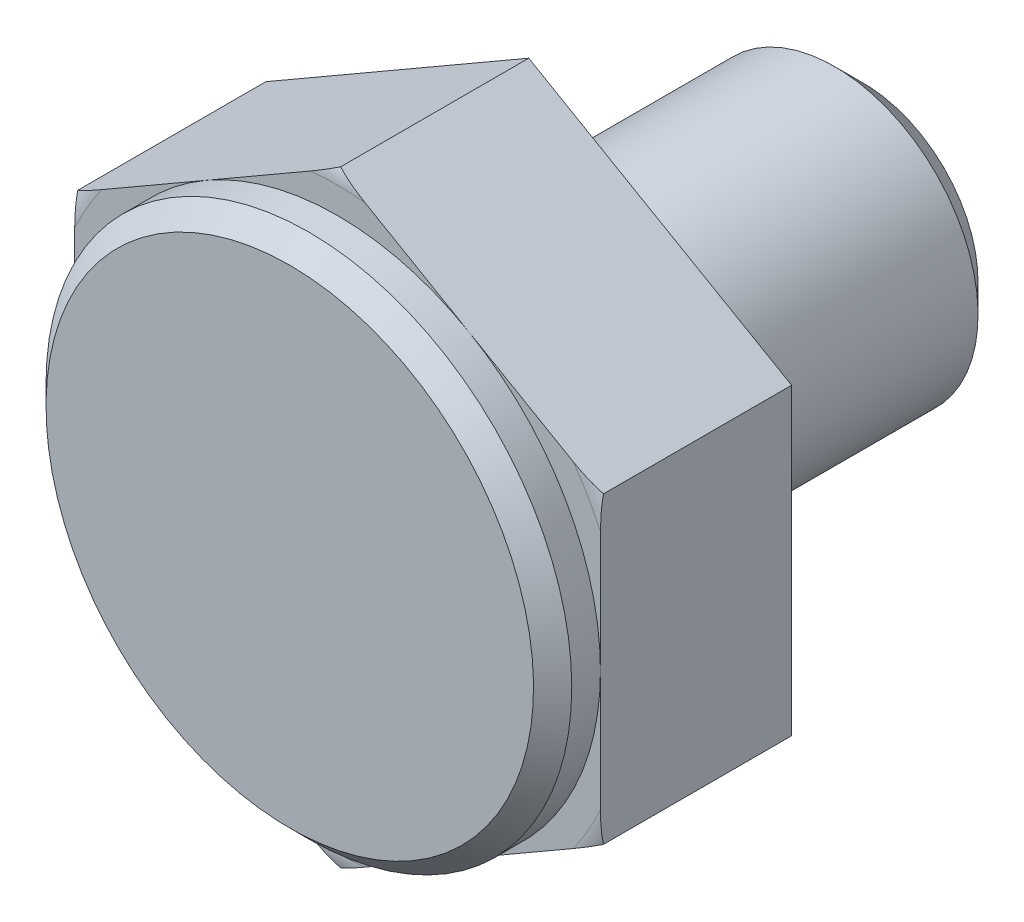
ISO-10303-21;
HEADER;
FILE_DESCRIPTION(('STEP AP214'),'2;1');
FILE_NAME('part.step','',(''),(''),'','','');
FILE_SCHEMA(('AUTOMOTIVE_DESIGN { 1 0 10303 214 1 1 1 1 }'));
ENDSEC;
DATA;
#1=APPLICATION_CONTEXT('core data for automotive mechanical design processes');
#2=APPLICATION_PROTOCOL_DEFINITION('international standard','automotive_design',2000,#1);
#3=PRODUCT_CONTEXT('',#1,'mechanical');
#4=PRODUCT('Part','Part','',(#3));
#5=PRODUCT_RELATED_PRODUCT_CATEGORY('part','',(#4));
#6=PRODUCT_DEFINITION_FORMATION('','',#4);
#7=PRODUCT_DEFINITION_CONTEXT('part definition',#1,'design');
#8=PRODUCT_DEFINITION('design','',#6,#7);
#9=PRODUCT_DEFINITION_SHAPE('','',#8);
#10=(LENGTH_UNIT() NAMED_UNIT(*) SI_UNIT(.MILLI.,.METRE.));
#11=(NAMED_UNIT(*) PLANE_ANGLE_UNIT() SI_UNIT($,.RADIAN.));
#12=(NAMED_UNIT(*) SI_UNIT($,.STERADIAN.) SOLID_ANGLE_UNIT());
#13=UNCERTAINTY_MEASURE_WITH_UNIT(LENGTH_MEASURE(1.E-05),#10,'distance_accuracy_value','');
#14=(GEOMETRIC_REPRESENTATION_CONTEXT(3) GLOBAL_UNCERTAINTY_ASSIGNED_CONTEXT((#13)) GLOBAL_UNIT_ASSIGNED_CONTEXT((#10,
#11,#12)) REPRESENTATION_CONTEXT('',''));
#15=CARTESIAN_POINT('',(0.,0.,0.));
#16=DIRECTION('',(0.,0.,1.));
#17=DIRECTION('',(1.,0.,0.));
#18=AXIS2_PLACEMENT_3D('',#15,#16,#17);
#19=CARTESIAN_POINT('',(5.1,0.,10.));
#20=DIRECTION('',(0.,0.,1.));
#21=DIRECTION('',(0.,-1.,0.));
#22=AXIS2_PLACEMENT_3D('',#19,#20,#21);
#23=PLANE('',#22);
#24=CARTESIAN_POINT('',(0.,0.,10.));
#25=DIRECTION('',(0.,0.,-1.));
#26=DIRECTION('',(0.,1.,0.));
#27=AXIS2_PLACEMENT_3D('',#24,#25,#26);
#28=CIRCLE('',#27,10.2);
#29=CARTESIAN_POINT('',(0.,10.2,10.));
#30=VERTEX_POINT('',#29);
#31=EDGE_CURVE('E18',#30,#30,#28,.T.);
#32=ORIENTED_EDGE('',*,*,#31,.F.);
#33=EDGE_LOOP('',(#32));
#34=FACE_BOUND('',#33,.T.);
#35=ADVANCED_FACE('F14',(#34),#23,.T.);
#36=CARTESIAN_POINT('',(2.4,0.,-14.));
#37=DIRECTION('',(0.,0.,-1.));
#38=DIRECTION('',(0.,1.,0.));
#39=AXIS2_PLACEMENT_3D('',#36,#37,#38);
#40=PLANE('',#39);
#41=CARTESIAN_POINT('',(0.,0.,-14.00000000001));
#42=DIRECTION('',(0.,0.,1.));
#43=DIRECTION('',(0.,-1.,0.));
#44=AXIS2_PLACEMENT_3D('',#41,#42,#43);
#45=CIRCLE('',#44,4.79999999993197);
#46=CARTESIAN_POINT('',(0.,-4.79999999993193,-14.00000000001));
#47=VERTEX_POINT('',#46);
#48=EDGE_CURVE('E150',#47,#47,#45,.T.);
#49=ORIENTED_EDGE('',*,*,#48,.F.);
#50=EDGE_LOOP('',(#49));
#51=FACE_BOUND('',#50,.T.);
#52=ADVANCED_FACE('F648',(#51),#40,.T.);
#53=CARTESIAN_POINT('',(0.,0.,9.2));
#54=DIRECTION('',(0.,0.,-1.));
#55=DIRECTION('',(0.,1.,0.));
#56=AXIS2_PLACEMENT_3D('',#53,#54,#55);
#57=CONICAL_SURFACE('',#56,11.,0.785398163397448);
#58=CARTESIAN_POINT('',(0.,0.,9.2));
#59=DIRECTION('',(0.,0.,1.));
#60=DIRECTION('',(0.,-1.,0.));
#61=AXIS2_PLACEMENT_3D('',#58,#59,#60);
#62=CIRCLE('',#61,11.);
#63=CARTESIAN_POINT('',(0.,-11.,9.19999999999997));
#64=VERTEX_POINT('',#63);
#65=EDGE_CURVE('E248',#64,#64,#62,.F.);
#66=ORIENTED_EDGE('',*,*,#65,.F.);
#67=EDGE_LOOP('',(#66));
#68=FACE_BOUND('',#67,.T.);
#69=ORIENTED_EDGE('',*,*,#31,.T.);
#70=EDGE_LOOP('',(#69));
#71=FACE_BOUND('',#70,.T.);
#72=ADVANCED_FACE('F645',(#68,#71),#57,.T.);
#73=CARTESIAN_POINT('',(0.,0.,-12.800000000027));
#74=DIRECTION('',(0.,0.,1.));
#75=DIRECTION('',(0.,-1.,0.));
#76=AXIS2_PLACEMENT_3D('',#73,#74,#75);
#77=CONICAL_SURFACE('',#76,5.99999999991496,0.785398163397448);
#78=CARTESIAN_POINT('',(0.,0.,-12.8));
#79=DIRECTION('',(0.,0.,1.));
#80=DIRECTION('',(0.,-1.,0.));
#81=AXIS2_PLACEMENT_3D('',#78,#79,#80);
#82=CIRCLE('',#81,6.);
#83=CARTESIAN_POINT('',(0.,-5.99999999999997,-12.8));
#84=VERTEX_POINT('',#83);
#85=EDGE_CURVE('E240',#84,#84,#82,.T.);
#86=ORIENTED_EDGE('',*,*,#85,.F.);
#87=EDGE_LOOP('',(#86));
#88=FACE_BOUND('',#87,.T.);
#89=ORIENTED_EDGE('',*,*,#48,.T.);
#90=EDGE_LOOP('',(#89));
#91=FACE_BOUND('',#90,.T.);
#92=ADVANCED_FACE('F176',(#88,#91),#77,.T.);
#93=CARTESIAN_POINT('',(0.,0.,6.50000000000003));
#94=DIRECTION('',(0.,0.,1.));
#95=DIRECTION('',(0.,-1.,0.));
#96=AXIS2_PLACEMENT_3D('',#93,#94,#95);
#97=TOROIDAL_SURFACE('',#96,12.1,1.5);
#98=CARTESIAN_POINT('',(11.,6.35085296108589,7.87402692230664));
#99=CARTESIAN_POINT('',(10.9533847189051,6.37776630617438,7.88580897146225));
#100=CARTESIAN_POINT('',(10.9065853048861,6.40478596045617,7.89659032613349));
#101=CARTESIAN_POINT('',(10.8128105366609,6.45892684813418,7.91627738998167));
#102=CARTESIAN_POINT('',(10.7658359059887,6.48604766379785,7.92518768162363));
#103=CARTESIAN_POINT('',(10.6717358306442,6.54037636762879,7.94130420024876));
#104=CARTESIAN_POINT('',(10.6246106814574,6.56758408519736,7.94851274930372));
#105=CARTESIAN_POINT('',(10.5302268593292,6.62207661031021,7.96136874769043));
#106=CARTESIAN_POINT('',(10.4829682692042,6.64936137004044,7.96701701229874));
#107=CARTESIAN_POINT('',(10.3883607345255,6.70398305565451,7.97687519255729));
#108=CARTESIAN_POINT('',(10.3410118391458,6.73131995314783,7.9810857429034));
#109=CARTESIAN_POINT('',(10.2461988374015,6.78606026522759,7.98818440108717));
#110=CARTESIAN_POINT('',(10.198734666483,6.81346371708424,7.99107134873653));
#111=CARTESIAN_POINT('',(10.1036948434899,6.86833498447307,7.99562221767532));
#112=CARTESIAN_POINT('',(10.0561191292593,6.89580283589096,7.99728437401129));
#113=CARTESIAN_POINT('',(9.9608582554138,6.95080172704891,7.99947376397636));
#114=CARTESIAN_POINT('',(9.9131730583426,6.97833278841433,7.9999988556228));
#115=CARTESIAN_POINT('',(9.86548966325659,7.00586280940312,8.));
#116=B_SPLINE_CURVE_WITH_KNOTS('',3,(#98,#99,#100,#101,#102,#103,#104,#105,#106,#107,#108,#109,
#110,#111,#112,#113,#114,#115),.UNSPECIFIED.,.F.,.F.,(4,2,2,2,2,2,2,2,4),(0.,0.165284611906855,
0.330159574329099,0.494808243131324,0.65937071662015,0.823860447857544,0.988494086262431,
1.1533645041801,1.31854523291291),.UNSPECIFIED.);
#117=CARTESIAN_POINT('',(11.,6.35085296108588,7.87402692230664));
#118=VERTEX_POINT('',#117);
#119=CARTESIAN_POINT('',(9.86548966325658,7.00586280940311,8.));
#120=VERTEX_POINT('',#119);
#121=EDGE_CURVE('E123',#118,#120,#116,.T.);
#122=ORIENTED_EDGE('',*,*,#121,.T.);
#123=CARTESIAN_POINT('',(0.,0.,8.00000000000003));
#124=DIRECTION('',(0.,0.,-1.));
#125=DIRECTION('',(0.81532972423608,0.578996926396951,0.));
#126=AXIS2_PLACEMENT_3D('',#123,#124,#125);
#127=CIRCLE('',#126,12.1);
#128=CARTESIAN_POINT('',(11.,5.0408332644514,8.));
#129=VERTEX_POINT('',#128);
#130=EDGE_CURVE('E147',#129,#120,#127,.F.);
#131=ORIENTED_EDGE('',*,*,#130,.F.);
#132=CARTESIAN_POINT('',(11.,5.0408332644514,8.));
#133=CARTESIAN_POINT('',(11.,5.09589330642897,7.9999988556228));
#134=CARTESIAN_POINT('',(11.,5.15095542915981,7.99947376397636));
#135=CARTESIAN_POINT('',(11.,5.26095321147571,7.99728437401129));
#136=CARTESIAN_POINT('',(11.,5.31588891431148,7.99562221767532));
#137=CARTESIAN_POINT('',(11.,5.42563144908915,7.99107134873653));
#138=CARTESIAN_POINT('',(11.,5.48043835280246,7.98818440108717));
#139=CARTESIAN_POINT('',(11.,5.58991897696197,7.9810857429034));
#140=CARTESIAN_POINT('',(11.,5.64459277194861,7.97687519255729));
#141=CARTESIAN_POINT('',(11.,5.75383614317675,7.96701701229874));
#142=CARTESIAN_POINT('',(11.,5.80840566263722,7.96136874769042));
#143=CARTESIAN_POINT('',(11.,5.91739071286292,7.94851274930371));
#144=CARTESIAN_POINT('',(11.,5.97180614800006,7.94130420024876));
#145=CARTESIAN_POINT('',(11.,6.08046355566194,7.92518768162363));
#146=CARTESIAN_POINT('',(11.,6.13470518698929,7.91627738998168));
#147=CARTESIAN_POINT('',(11.,6.24298696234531,7.89659032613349));
#148=CARTESIAN_POINT('',(11.,6.29702627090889,7.88580897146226));
#149=CARTESIAN_POINT('',(11.,6.35085296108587,7.87402692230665));
#150=B_SPLINE_CURVE_WITH_KNOTS('',3,(#132,#133,#134,#135,#136,#137,#138,#139,#140,#141,#142,
#143,#144,#145,#146,#147,#148,#149),.UNSPECIFIED.,.F.,.F.,(4,2,2,2,2,2,2,2,4),(0.,
0.16518072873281,0.330051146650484,0.494684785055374,0.659174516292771,0.8237369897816,
0.988385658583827,1.15326062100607,1.31854523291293),.UNSPECIFIED.);
#151=EDGE_CURVE('E136',#129,#118,#150,.T.);
#152=ORIENTED_EDGE('',*,*,#151,.T.);
#153=EDGE_LOOP('',(#122,#131,#152));
#154=FACE_BOUND('',#153,.T.);
#155=ADVANCED_FACE('F146',(#154),#97,.T.);
#156=CARTESIAN_POINT('',(0.,0.,6.50000000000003));
#157=DIRECTION('',(0.,0.,1.));
#158=DIRECTION('',(0.,-1.,0.));
#159=AXIS2_PLACEMENT_3D('',#156,#157,#158);
#160=TOROIDAL_SURFACE('',#159,12.1,1.5);
#161=CARTESIAN_POINT('',(0.,0.,8.00000000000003));
#162=DIRECTION('',(0.,0.,-1.));
#163=DIRECTION('',(0.909090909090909,-0.416597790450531,0.));
#164=AXIS2_PLACEMENT_3D('',#161,#162,#163);
#165=CIRCLE('',#164,12.1);
#166=CARTESIAN_POINT('',(9.86548966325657,-7.00586280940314,8.));
#167=VERTEX_POINT('',#166);
#168=CARTESIAN_POINT('',(11.,-5.04083326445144,8.));
#169=VERTEX_POINT('',#168);
#170=EDGE_CURVE('E227',#167,#169,#165,.F.);
#171=ORIENTED_EDGE('',*,*,#170,.F.);
#172=CARTESIAN_POINT('',(9.86548966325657,-7.00586280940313,8.));
#173=CARTESIAN_POINT('',(9.91317305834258,-6.97833278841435,7.99999885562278));
#174=CARTESIAN_POINT('',(9.96085825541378,-6.95080172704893,7.99947376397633));
#175=CARTESIAN_POINT('',(10.0561191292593,-6.89580283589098,7.99728437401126));
#176=CARTESIAN_POINT('',(10.1036948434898,-6.86833498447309,7.99562221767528));
#177=CARTESIAN_POINT('',(10.198734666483,-6.81346371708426,7.9910713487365));
#178=CARTESIAN_POINT('',(10.2461988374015,-6.78606026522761,7.98818440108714));
#179=CARTESIAN_POINT('',(10.3410118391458,-6.73131995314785,7.98108574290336));
#180=CARTESIAN_POINT('',(10.3883607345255,-6.70398305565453,7.97687519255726));
#181=CARTESIAN_POINT('',(10.4829682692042,-6.64936137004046,7.96701701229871));
#182=CARTESIAN_POINT('',(10.5302268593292,-6.62207661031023,7.96136874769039));
#183=CARTESIAN_POINT('',(10.6246106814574,-6.56758408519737,7.94851274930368));
#184=CARTESIAN_POINT('',(10.6717358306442,-6.54037636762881,7.94130420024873));
#185=CARTESIAN_POINT('',(10.7658359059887,-6.48604766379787,7.9251876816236));
#186=CARTESIAN_POINT('',(10.8128105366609,-6.45892684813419,7.91627738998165));
#187=CARTESIAN_POINT('',(10.9065853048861,-6.40478596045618,7.89659032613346));
#188=CARTESIAN_POINT('',(10.9533847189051,-6.37776630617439,7.88580897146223));
#189=CARTESIAN_POINT('',(11.,-6.3508529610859,7.87402692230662));
#190=B_SPLINE_CURVE_WITH_KNOTS('',3,(#172,#173,#174,#175,#176,#177,#178,#179,#180,#181,#182,
#183,#184,#185,#186,#187,#188,#189),.UNSPECIFIED.,.F.,.F.,(4,2,2,2,2,2,2,2,4),(0.,
0.165180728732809,0.330051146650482,0.494684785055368,0.659174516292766,0.823736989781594,
0.988385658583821,1.15326062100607,1.31854523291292),.UNSPECIFIED.);
#191=CARTESIAN_POINT('',(11.,-6.3508529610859,7.87402692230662));
#192=VERTEX_POINT('',#191);
#193=EDGE_CURVE('E585',#167,#192,#190,.T.);
#194=ORIENTED_EDGE('',*,*,#193,.T.);
#195=CARTESIAN_POINT('',(11.,-6.3508529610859,7.87402692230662));
#196=CARTESIAN_POINT('',(11.,-6.29702627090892,7.88580897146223));
#197=CARTESIAN_POINT('',(11.,-6.24298696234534,7.89659032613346));
#198=CARTESIAN_POINT('',(11.,-6.13470518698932,7.91627738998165));
#199=CARTESIAN_POINT('',(11.,-6.08046355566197,7.9251876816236));
#200=CARTESIAN_POINT('',(11.,-5.97180614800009,7.94130420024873));
#201=CARTESIAN_POINT('',(11.,-5.91739071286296,7.94851274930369));
#202=CARTESIAN_POINT('',(11.,-5.80840566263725,7.9613687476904));
#203=CARTESIAN_POINT('',(11.,-5.75383614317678,7.96701701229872));
#204=CARTESIAN_POINT('',(11.,-5.64459277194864,7.97687519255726));
#205=CARTESIAN_POINT('',(11.,-5.589918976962,7.98108574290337));
#206=CARTESIAN_POINT('',(11.,-5.48043835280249,7.98818440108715));
#207=CARTESIAN_POINT('',(11.,-5.42563144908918,7.9910713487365));
#208=CARTESIAN_POINT('',(11.,-5.31588891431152,7.99562221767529));
#209=CARTESIAN_POINT('',(11.,-5.26095321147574,7.99728437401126));
#210=CARTESIAN_POINT('',(11.,-5.15095542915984,7.99947376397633));
#211=CARTESIAN_POINT('',(11.,-5.095893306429,7.99999885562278));
#212=CARTESIAN_POINT('',(11.,-5.04083326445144,8.));
#213=B_SPLINE_CURVE_WITH_KNOTS('',3,(#195,#196,#197,#198,#199,#200,#201,#202,#203,#204,#205,
#206,#207,#208,#209,#210,#211,#212),.UNSPECIFIED.,.F.,.F.,(4,2,2,2,2,2,2,2,4),(0.,
0.165284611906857,0.330159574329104,0.49480824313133,0.659370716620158,0.823860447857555,
0.988494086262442,1.15336450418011,1.31854523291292),.UNSPECIFIED.);
#214=EDGE_CURVE('E118',#192,#169,#213,.T.);
#215=ORIENTED_EDGE('',*,*,#214,.T.);
#216=EDGE_LOOP('',(#171,#194,#215));
#217=FACE_BOUND('',#216,.T.);
#218=ADVANCED_FACE('F175',(#217),#160,.T.);
#219=CARTESIAN_POINT('',(0.,0.,6.50000000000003));
#220=DIRECTION('',(0.,0.,1.));
#221=DIRECTION('',(0.,-1.,0.));
#222=AXIS2_PLACEMENT_3D('',#219,#220,#221);
#223=TOROIDAL_SURFACE('',#222,12.1,1.5);
#224=CARTESIAN_POINT('',(0.,0.,8.00000000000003));
#225=DIRECTION('',(0.,0.,-1.));
#226=DIRECTION('',(0.0937611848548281,-0.995594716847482,0.));
#227=AXIS2_PLACEMENT_3D('',#224,#225,#226);
#228=CIRCLE('',#227,12.1);
#229=CARTESIAN_POINT('',(-1.13451033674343,-12.0466960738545,8.));
#230=VERTEX_POINT('',#229);
#231=CARTESIAN_POINT('',(1.13451033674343,-12.0466960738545,8.));
#232=VERTEX_POINT('',#231);
#233=EDGE_CURVE('E265',#230,#232,#228,.F.);
#234=ORIENTED_EDGE('',*,*,#233,.F.);
#235=CARTESIAN_POINT('',(-1.13451033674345,-12.0466960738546,8.));
#236=CARTESIAN_POINT('',(-1.08682694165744,-12.0742260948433,7.99999885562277));
#237=CARTESIAN_POINT('',(-1.03914174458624,-12.1017571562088,7.99947376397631));
#238=CARTESIAN_POINT('',(-0.943880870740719,-12.1567560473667,7.99728437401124));
#239=CARTESIAN_POINT('',(-0.896305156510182,-12.1842238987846,7.99562221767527));
#240=CARTESIAN_POINT('',(-0.801265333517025,-12.2390951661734,7.99107134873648));
#241=CARTESIAN_POINT('',(-0.753801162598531,-12.2664986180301,7.98818440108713));
#242=CARTESIAN_POINT('',(-0.658988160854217,-12.3212389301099,7.98108574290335));
#243=CARTESIAN_POINT('',(-0.611639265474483,-12.3485758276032,7.97687519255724));
#244=CARTESIAN_POINT('',(-0.51703173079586,-12.4031975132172,7.96701701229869));
#245=CARTESIAN_POINT('',(-0.469773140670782,-12.4304822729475,7.96136874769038));
#246=CARTESIAN_POINT('',(-0.375389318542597,-12.4849747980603,7.94851274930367));
#247=CARTESIAN_POINT('',(-0.328264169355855,-12.5121825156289,7.94130420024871));
#248=CARTESIAN_POINT('',(-0.234164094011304,-12.5665112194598,7.92518768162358));
#249=CARTESIAN_POINT('',(-0.187189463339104,-12.5936320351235,7.91627738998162));
#250=CARTESIAN_POINT('',(-0.0934146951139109,-12.6477729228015,7.89659032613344));
#251=CARTESIAN_POINT('',(-0.0466152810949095,-12.6747925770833,7.8858089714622));
#252=CARTESIAN_POINT('',(0.,-12.7017059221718,7.87402692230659));
#253=B_SPLINE_CURVE_WITH_KNOTS('',3,(#235,#236,#237,#238,#239,#240,#241,#242,#243,#244,#245,
#246,#247,#248,#249,#250,#251,#252),.UNSPECIFIED.,.F.,.F.,(4,2,2,2,2,2,2,2,4),(0.,
0.165180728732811,0.330051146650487,0.494684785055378,0.659174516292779,0.823736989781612,
0.98838565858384,1.15326062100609,1.31854523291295),.UNSPECIFIED.);
#254=CARTESIAN_POINT('',(0.,-12.7017059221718,7.8740269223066));
#255=VERTEX_POINT('',#254);
#256=EDGE_CURVE('E542',#230,#255,#253,.T.);
#257=ORIENTED_EDGE('',*,*,#256,.T.);
#258=CARTESIAN_POINT('',(0.,-12.7017059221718,7.8740269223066));
#259=CARTESIAN_POINT('',(0.0466152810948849,-12.6747925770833,7.88580897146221));
#260=CARTESIAN_POINT('',(0.09341469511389,-12.6477729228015,7.89659032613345));
#261=CARTESIAN_POINT('',(0.187189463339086,-12.5936320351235,7.91627738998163));
#262=CARTESIAN_POINT('',(0.234164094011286,-12.5665112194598,7.92518768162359));
#263=CARTESIAN_POINT('',(0.328264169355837,-12.5121825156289,7.94130420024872));
#264=CARTESIAN_POINT('',(0.375389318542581,-12.4849747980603,7.94851274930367));
#265=CARTESIAN_POINT('',(0.469773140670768,-12.4304822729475,7.96136874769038));
#266=CARTESIAN_POINT('',(0.517031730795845,-12.4031975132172,7.9670170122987));
#267=CARTESIAN_POINT('',(0.611639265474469,-12.3485758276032,7.97687519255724));
#268=CARTESIAN_POINT('',(0.658988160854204,-12.3212389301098,7.98108574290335));
#269=CARTESIAN_POINT('',(0.753801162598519,-12.2664986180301,7.98818440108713));
#270=CARTESIAN_POINT('',(0.801265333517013,-12.2390951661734,7.99107134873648));
#271=CARTESIAN_POINT('',(0.896305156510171,-12.1842238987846,7.99562221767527));
#272=CARTESIAN_POINT('',(0.943880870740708,-12.1567560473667,7.99728437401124));
#273=CARTESIAN_POINT('',(1.03914174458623,-12.1017571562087,7.99947376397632));
#274=CARTESIAN_POINT('',(1.08682694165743,-12.0742260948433,7.99999885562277));
#275=CARTESIAN_POINT('',(1.13451033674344,-12.0466960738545,8.));
#276=B_SPLINE_CURVE_WITH_KNOTS('',3,(#258,#259,#260,#261,#262,#263,#264,#265,#266,#267,#268,
#269,#270,#271,#272,#273,#274,#275),.UNSPECIFIED.,.F.,.F.,(4,2,2,2,2,2,2,2,4),(0.,
0.165284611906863,0.330159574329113,0.494808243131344,0.659370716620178,0.823860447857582,
0.988494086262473,1.15336450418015,1.31854523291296),.UNSPECIFIED.);
#277=EDGE_CURVE('E592',#255,#232,#276,.T.);
#278=ORIENTED_EDGE('',*,*,#277,.T.);
#279=EDGE_LOOP('',(#234,#257,#278));
#280=FACE_BOUND('',#279,.T.);
#281=ADVANCED_FACE('F190',(#280),#223,.T.);
#282=CARTESIAN_POINT('',(0.,0.,6.50000000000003));
#283=DIRECTION('',(0.,0.,1.));
#284=DIRECTION('',(0.,-1.,0.));
#285=AXIS2_PLACEMENT_3D('',#282,#283,#284);
#286=TOROIDAL_SURFACE('',#285,12.1,1.5);
#287=CARTESIAN_POINT('',(0.,0.,8.00000000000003));
#288=DIRECTION('',(0.,0.,-1.));
#289=DIRECTION('',(-0.815329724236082,-0.578996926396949,0.));
#290=AXIS2_PLACEMENT_3D('',#287,#288,#289);
#291=CIRCLE('',#290,12.1);
#292=CARTESIAN_POINT('',(-11.,-5.04083326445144,8.));
#293=VERTEX_POINT('',#292);
#294=CARTESIAN_POINT('',(-9.86548966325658,-7.00586280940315,8.));
#295=VERTEX_POINT('',#294);
#296=EDGE_CURVE('E264',#293,#295,#291,.F.);
#297=ORIENTED_EDGE('',*,*,#296,.F.);
#298=CARTESIAN_POINT('',(-11.,-5.04083326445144,8.));
#299=CARTESIAN_POINT('',(-11.,-5.095893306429,7.99999885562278));
#300=CARTESIAN_POINT('',(-11.,-5.15095542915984,7.99947376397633));
#301=CARTESIAN_POINT('',(-11.,-5.26095321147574,7.99728437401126));
#302=CARTESIAN_POINT('',(-11.,-5.31588891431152,7.99562221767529));
#303=CARTESIAN_POINT('',(-11.,-5.42563144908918,7.9910713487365));
#304=CARTESIAN_POINT('',(-11.,-5.48043835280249,7.98818440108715));
#305=CARTESIAN_POINT('',(-11.,-5.589918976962,7.98108574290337));
#306=CARTESIAN_POINT('',(-11.,-5.64459277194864,7.97687519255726));
#307=CARTESIAN_POINT('',(-11.,-5.75383614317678,7.96701701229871));
#308=CARTESIAN_POINT('',(-11.,-5.80840566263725,7.9613687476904));
#309=CARTESIAN_POINT('',(-11.,-5.91739071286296,7.94851274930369));
#310=CARTESIAN_POINT('',(-11.,-5.97180614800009,7.94130420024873));
#311=CARTESIAN_POINT('',(-11.,-6.08046355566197,7.9251876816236));
#312=CARTESIAN_POINT('',(-11.,-6.13470518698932,7.91627738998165));
#313=CARTESIAN_POINT('',(-11.,-6.24298696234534,7.89659032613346));
#314=CARTESIAN_POINT('',(-11.,-6.29702627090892,7.88580897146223));
#315=CARTESIAN_POINT('',(-11.,-6.3508529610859,7.87402692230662));
#316=B_SPLINE_CURVE_WITH_KNOTS('',3,(#298,#299,#300,#301,#302,#303,#304,#305,#306,#307,#308,
#309,#310,#311,#312,#313,#314,#315),.UNSPECIFIED.,.F.,.F.,(4,2,2,2,2,2,2,2,4),(0.,
0.165180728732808,0.330051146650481,0.494684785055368,0.659174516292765,0.823736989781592,
0.988385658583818,1.15326062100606,1.31854523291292),.UNSPECIFIED.);
#317=CARTESIAN_POINT('',(-11.,-6.35085296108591,7.87402692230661));
#318=VERTEX_POINT('',#317);
#319=EDGE_CURVE('E534',#293,#318,#316,.T.);
#320=ORIENTED_EDGE('',*,*,#319,.T.);
#321=CARTESIAN_POINT('',(-11.,-6.35085296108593,7.87402692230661));
#322=CARTESIAN_POINT('',(-10.9533847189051,-6.37776630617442,7.88580897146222));
#323=CARTESIAN_POINT('',(-10.9065853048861,-6.40478596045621,7.89659032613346));
#324=CARTESIAN_POINT('',(-10.8128105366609,-6.45892684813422,7.91627738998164));
#325=CARTESIAN_POINT('',(-10.7658359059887,-6.4860476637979,7.9251876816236));
#326=CARTESIAN_POINT('',(-10.6717358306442,-6.54037636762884,7.94130420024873));
#327=CARTESIAN_POINT('',(-10.6246106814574,-6.5675840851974,7.94851274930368));
#328=CARTESIAN_POINT('',(-10.5302268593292,-6.62207661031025,7.96136874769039));
#329=CARTESIAN_POINT('',(-10.4829682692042,-6.64936137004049,7.96701701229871));
#330=CARTESIAN_POINT('',(-10.3883607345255,-6.70398305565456,7.97687519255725));
#331=CARTESIAN_POINT('',(-10.3410118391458,-6.73131995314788,7.98108574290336));
#332=CARTESIAN_POINT('',(-10.2461988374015,-6.78606026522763,7.98818440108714));
#333=CARTESIAN_POINT('',(-10.198734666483,-6.81346371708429,7.99107134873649));
#334=CARTESIAN_POINT('',(-10.1036948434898,-6.86833498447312,7.99562221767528));
#335=CARTESIAN_POINT('',(-10.0561191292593,-6.89580283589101,7.99728437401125));
#336=CARTESIAN_POINT('',(-9.96085825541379,-6.95080172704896,7.99947376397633));
#337=CARTESIAN_POINT('',(-9.91317305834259,-6.97833278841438,7.99999885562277));
#338=CARTESIAN_POINT('',(-9.86548966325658,-7.00586280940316,8.));
#339=B_SPLINE_CURVE_WITH_KNOTS('',3,(#321,#322,#323,#324,#325,#326,#327,#328,#329,#330,#331,
#332,#333,#334,#335,#336,#337,#338),.UNSPECIFIED.,.F.,.F.,(4,2,2,2,2,2,2,2,4),(0.,
0.165284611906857,0.330159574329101,0.494808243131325,0.659370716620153,0.823860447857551,
0.988494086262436,1.15336450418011,1.31854523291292),.UNSPECIFIED.);
#340=EDGE_CURVE('E535',#318,#295,#339,.T.);
#341=ORIENTED_EDGE('',*,*,#340,.T.);
#342=EDGE_LOOP('',(#297,#320,#341));
#343=FACE_BOUND('',#342,.T.);
#344=ADVANCED_FACE('F194',(#343),#286,.T.);
#345=CARTESIAN_POINT('',(0.,0.,6.50000000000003));
#346=DIRECTION('',(0.,0.,1.));
#347=DIRECTION('',(0.,-1.,0.));
#348=AXIS2_PLACEMENT_3D('',#345,#346,#347);
#349=TOROIDAL_SURFACE('',#348,12.1,1.5);
#350=CARTESIAN_POINT('',(0.,12.7017059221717,7.87402692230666));
#351=CARTESIAN_POINT('',(-0.0466152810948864,12.6747925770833,7.88580897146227));
#352=CARTESIAN_POINT('',(-0.0934146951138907,12.6477729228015,7.89659032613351));
#353=CARTESIAN_POINT('',(-0.187189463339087,12.5936320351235,7.91627738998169));
#354=CARTESIAN_POINT('',(-0.234164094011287,12.5665112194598,7.92518768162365));
#355=CARTESIAN_POINT('',(-0.328264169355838,12.5121825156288,7.94130420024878));
#356=CARTESIAN_POINT('',(-0.375389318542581,12.4849747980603,7.94851274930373));
#357=CARTESIAN_POINT('',(-0.469773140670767,12.4304822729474,7.96136874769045));
#358=CARTESIAN_POINT('',(-0.517031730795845,12.4031975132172,7.96701701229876));
#359=CARTESIAN_POINT('',(-0.611639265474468,12.3485758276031,7.9768751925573));
#360=CARTESIAN_POINT('',(-0.658988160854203,12.3212389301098,7.98108574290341));
#361=CARTESIAN_POINT('',(-0.753801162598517,12.26649861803,7.98818440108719));
#362=CARTESIAN_POINT('',(-0.801265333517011,12.2390951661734,7.99107134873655));
#363=CARTESIAN_POINT('',(-0.896305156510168,12.1842238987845,7.99562221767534));
#364=CARTESIAN_POINT('',(-0.943880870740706,12.1567560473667,7.99728437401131));
#365=CARTESIAN_POINT('',(-1.03914174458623,12.1017571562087,7.99947376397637));
#366=CARTESIAN_POINT('',(-1.08682694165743,12.0742260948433,7.9999988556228));
#367=CARTESIAN_POINT('',(-1.13451033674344,12.0466960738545,8.));
#368=B_SPLINE_CURVE_WITH_KNOTS('',3,(#350,#351,#352,#353,#354,#355,#356,#357,#358,#359,#360,
#361,#362,#363,#364,#365,#366,#367),.UNSPECIFIED.,.F.,.F.,(4,2,2,2,2,2,2,2,4),(0.,
0.165284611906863,0.330159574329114,0.494808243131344,0.659370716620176,0.823860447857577,
0.988494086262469,1.15336450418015,1.31854523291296),.UNSPECIFIED.);
#369=CARTESIAN_POINT('',(0.,12.7017059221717,7.87402692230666));
#370=VERTEX_POINT('',#369);
#371=CARTESIAN_POINT('',(-1.13451033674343,12.0466960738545,8.));
#372=VERTEX_POINT('',#371);
#373=EDGE_CURVE('E540',#370,#372,#368,.T.);
#374=ORIENTED_EDGE('',*,*,#373,.T.);
#375=CARTESIAN_POINT('',(0.,0.,8.00000000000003));
#376=DIRECTION('',(0.,0.,-1.));
#377=DIRECTION('',(-0.0937611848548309,0.995594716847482,0.));
#378=AXIS2_PLACEMENT_3D('',#375,#376,#377);
#379=CIRCLE('',#378,12.1);
#380=CARTESIAN_POINT('',(1.13451033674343,12.0466960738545,8.));
#381=VERTEX_POINT('',#380);
#382=EDGE_CURVE('E260',#381,#372,#379,.F.);
#383=ORIENTED_EDGE('',*,*,#382,.F.);
#384=CARTESIAN_POINT('',(1.13451033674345,12.0466960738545,8.));
#385=CARTESIAN_POINT('',(1.08682694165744,12.0742260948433,7.9999988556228));
#386=CARTESIAN_POINT('',(1.03914174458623,12.1017571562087,7.99947376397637));
#387=CARTESIAN_POINT('',(0.94388087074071,12.1567560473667,7.99728437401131));
#388=CARTESIAN_POINT('',(0.896305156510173,12.1842238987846,7.99562221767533));
#389=CARTESIAN_POINT('',(0.801265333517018,12.2390951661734,7.99107134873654));
#390=CARTESIAN_POINT('',(0.753801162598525,12.2664986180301,7.98818440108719));
#391=CARTESIAN_POINT('',(0.658988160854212,12.3212389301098,7.98108574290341));
#392=CARTESIAN_POINT('',(0.611639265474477,12.3485758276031,7.9768751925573));
#393=CARTESIAN_POINT('',(0.517031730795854,12.4031975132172,7.96701701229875));
#394=CARTESIAN_POINT('',(0.469773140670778,12.4304822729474,7.96136874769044));
#395=CARTESIAN_POINT('',(0.375389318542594,12.4849747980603,7.94851274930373));
#396=CARTESIAN_POINT('',(0.328264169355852,12.5121825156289,7.94130420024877));
#397=CARTESIAN_POINT('',(0.234164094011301,12.5665112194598,7.92518768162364));
#398=CARTESIAN_POINT('',(0.187189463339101,12.5936320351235,7.91627738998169));
#399=CARTESIAN_POINT('',(0.0934146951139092,12.6477729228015,7.8965903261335));
#400=CARTESIAN_POINT('',(0.046615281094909,12.6747925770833,7.88580897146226));
#401=CARTESIAN_POINT('',(0.,12.7017059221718,7.87402692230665));
#402=B_SPLINE_CURVE_WITH_KNOTS('',3,(#384,#385,#386,#387,#388,#389,#390,#391,#392,#393,#394,
#395,#396,#397,#398,#399,#400,#401),.UNSPECIFIED.,.F.,.F.,(4,2,2,2,2,2,2,2,4),(0.,
0.165180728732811,0.330051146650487,0.494684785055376,0.659174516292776,0.823736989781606,
0.988385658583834,1.15326062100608,1.31854523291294),.UNSPECIFIED.);
#403=EDGE_CURVE('E538',#381,#370,#402,.T.);
#404=ORIENTED_EDGE('',*,*,#403,.T.);
#405=EDGE_LOOP('',(#374,#383,#404));
#406=FACE_BOUND('',#405,.T.);
#407=ADVANCED_FACE('F295',(#406),#349,.T.);
#408=CARTESIAN_POINT('',(0.,0.,6.50000000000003));
#409=DIRECTION('',(0.,0.,1.));
#410=DIRECTION('',(0.,-1.,0.));
#411=AXIS2_PLACEMENT_3D('',#408,#409,#410);
#412=TOROIDAL_SURFACE('',#411,12.1,1.5);
#413=CARTESIAN_POINT('',(-11.,6.35085296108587,7.87402692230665));
#414=CARTESIAN_POINT('',(-11.,6.29702627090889,7.88580897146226));
#415=CARTESIAN_POINT('',(-11.,6.24298696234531,7.89659032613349));
#416=CARTESIAN_POINT('',(-11.,6.13470518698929,7.91627738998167));
#417=CARTESIAN_POINT('',(-11.,6.08046355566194,7.92518768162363));
#418=CARTESIAN_POINT('',(-11.,5.97180614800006,7.94130420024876));
#419=CARTESIAN_POINT('',(-11.,5.91739071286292,7.94851274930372));
#420=CARTESIAN_POINT('',(-11.,5.80840566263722,7.96136874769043));
#421=CARTESIAN_POINT('',(-11.,5.75383614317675,7.96701701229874));
#422=CARTESIAN_POINT('',(-11.,5.64459277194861,7.97687519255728));
#423=CARTESIAN_POINT('',(-11.,5.58991897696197,7.98108574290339));
#424=CARTESIAN_POINT('',(-11.,5.48043835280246,7.98818440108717));
#425=CARTESIAN_POINT('',(-11.,5.42563144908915,7.99107134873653));
#426=CARTESIAN_POINT('',(-11.,5.31588891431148,7.99562221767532));
#427=CARTESIAN_POINT('',(-11.,5.2609532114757,7.99728437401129));
#428=CARTESIAN_POINT('',(-11.,5.15095542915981,7.99947376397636));
#429=CARTESIAN_POINT('',(-11.,5.09589330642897,7.9999988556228));
#430=CARTESIAN_POINT('',(-11.,5.0408332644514,8.));
#431=B_SPLINE_CURVE_WITH_KNOTS('',3,(#413,#414,#415,#416,#417,#418,#419,#420,#421,#422,#423,
#424,#425,#426,#427,#428,#429,#430),.UNSPECIFIED.,.F.,.F.,(4,2,2,2,2,2,2,2,4),(0.,
0.16528461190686,0.330159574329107,0.494808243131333,0.659370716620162,0.823860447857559,
0.988494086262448,1.15336450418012,1.31854523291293),.UNSPECIFIED.);
#432=CARTESIAN_POINT('',(-11.,6.35085296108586,7.87402692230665));
#433=VERTEX_POINT('',#432);
#434=CARTESIAN_POINT('',(-11.,5.0408332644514,8.));
#435=VERTEX_POINT('',#434);
#436=EDGE_CURVE('E250',#433,#435,#431,.T.);
#437=ORIENTED_EDGE('',*,*,#436,.T.);
#438=CARTESIAN_POINT('',(0.,0.,8.00000000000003));
#439=DIRECTION('',(0.,0.,-1.));
#440=DIRECTION('',(-0.909090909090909,0.416597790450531,0.));
#441=AXIS2_PLACEMENT_3D('',#438,#439,#440);
#442=CIRCLE('',#441,12.1);
#443=CARTESIAN_POINT('',(-9.86548966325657,7.0058628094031,8.));
#444=VERTEX_POINT('',#443);
#445=EDGE_CURVE('E256',#444,#435,#442,.F.);
#446=ORIENTED_EDGE('',*,*,#445,.F.);
#447=CARTESIAN_POINT('',(-9.86548966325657,7.00586280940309,8.));
#448=CARTESIAN_POINT('',(-9.91317305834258,6.97833278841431,7.9999988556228));
#449=CARTESIAN_POINT('',(-9.96085825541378,6.95080172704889,7.99947376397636));
#450=CARTESIAN_POINT('',(-10.0561191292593,6.89580283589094,7.99728437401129));
#451=CARTESIAN_POINT('',(-10.1036948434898,6.86833498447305,7.99562221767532));
#452=CARTESIAN_POINT('',(-10.198734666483,6.81346371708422,7.99107134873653));
#453=CARTESIAN_POINT('',(-10.2461988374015,6.78606026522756,7.98818440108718));
#454=CARTESIAN_POINT('',(-10.3410118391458,6.73131995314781,7.9810857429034));
#455=CARTESIAN_POINT('',(-10.3883607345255,6.70398305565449,7.97687519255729));
#456=CARTESIAN_POINT('',(-10.4829682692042,6.64936137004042,7.96701701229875));
#457=CARTESIAN_POINT('',(-10.5302268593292,6.62207661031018,7.96136874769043));
#458=CARTESIAN_POINT('',(-10.6246106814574,6.56758408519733,7.94851274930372));
#459=CARTESIAN_POINT('',(-10.6717358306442,6.54037636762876,7.94130420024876));
#460=CARTESIAN_POINT('',(-10.7658359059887,6.48604766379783,7.92518768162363));
#461=CARTESIAN_POINT('',(-10.8128105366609,6.45892684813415,7.91627738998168));
#462=CARTESIAN_POINT('',(-10.9065853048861,6.40478596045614,7.8965903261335));
#463=CARTESIAN_POINT('',(-10.9533847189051,6.37776630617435,7.88580897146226));
#464=CARTESIAN_POINT('',(-11.,6.35085296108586,7.87402692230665));
#465=B_SPLINE_CURVE_WITH_KNOTS('',3,(#447,#448,#449,#450,#451,#452,#453,#454,#455,#456,#457,
#458,#459,#460,#461,#462,#463,#464),.UNSPECIFIED.,.F.,.F.,(4,2,2,2,2,2,2,2,4),(0.,
0.165180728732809,0.330051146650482,0.49468478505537,0.659174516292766,0.823736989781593,
0.988385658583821,1.15326062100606,1.31854523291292),.UNSPECIFIED.);
#466=EDGE_CURVE('E276',#444,#433,#465,.T.);
#467=ORIENTED_EDGE('',*,*,#466,.T.);
#468=EDGE_LOOP('',(#437,#446,#467));
#469=FACE_BOUND('',#468,.T.);
#470=ADVANCED_FACE('F289',(#469),#412,.T.);
#471=CARTESIAN_POINT('',(0.,0.,8.6));
#472=DIRECTION('',(0.,0.,1.));
#473=DIRECTION('',(0.,-1.,0.));
#474=AXIS2_PLACEMENT_3D('',#471,#472,#473);
#475=CYLINDRICAL_SURFACE('',#474,11.);
#476=CARTESIAN_POINT('',(0.,0.,8.));
#477=DIRECTION('',(0.,0.,1.));
#478=DIRECTION('',(0.,-1.,0.));
#479=AXIS2_PLACEMENT_3D('',#476,#477,#478);
#480=CIRCLE('',#479,11.);
#481=CARTESIAN_POINT('',(11.,0.,8.));
#482=VERTEX_POINT('',#481);
#483=CARTESIAN_POINT('',(5.5,-9.52627944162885,8.));
#484=VERTEX_POINT('',#483);
#485=EDGE_CURVE('E269',#482,#484,#480,.F.);
#486=ORIENTED_EDGE('',*,*,#485,.F.);
#487=CARTESIAN_POINT('',(0.,0.,8.));
#488=DIRECTION('',(0.,0.,1.));
#489=DIRECTION('',(0.,-1.,0.));
#490=AXIS2_PLACEMENT_3D('',#487,#488,#489);
#491=CIRCLE('',#490,11.);
#492=CARTESIAN_POINT('',(5.5,9.52627944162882,8.));
#493=VERTEX_POINT('',#492);
#494=EDGE_CURVE('E272',#493,#482,#491,.F.);
#495=ORIENTED_EDGE('',*,*,#494,.F.);
#496=CARTESIAN_POINT('',(0.,0.,8.));
#497=DIRECTION('',(0.,0.,1.));
#498=DIRECTION('',(0.,-1.,0.));
#499=AXIS2_PLACEMENT_3D('',#496,#497,#498);
#500=CIRCLE('',#499,11.);
#501=CARTESIAN_POINT('',(-5.5,9.52627944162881,8.));
#502=VERTEX_POINT('',#501);
#503=EDGE_CURVE('E257',#502,#493,#500,.F.);
#504=ORIENTED_EDGE('',*,*,#503,.F.);
#505=CARTESIAN_POINT('',(0.,0.,8.));
#506=DIRECTION('',(0.,0.,1.));
#507=DIRECTION('',(0.,-1.,0.));
#508=AXIS2_PLACEMENT_3D('',#505,#506,#507);
#509=CIRCLE('',#508,11.);
#510=CARTESIAN_POINT('',(-11.,0.,8.));
#511=VERTEX_POINT('',#510);
#512=EDGE_CURVE('E252',#511,#502,#509,.F.);
#513=ORIENTED_EDGE('',*,*,#512,.F.);
#514=CARTESIAN_POINT('',(0.,0.,8.));
#515=DIRECTION('',(0.,0.,1.));
#516=DIRECTION('',(0.,-1.,0.));
#517=AXIS2_PLACEMENT_3D('',#514,#515,#516);
#518=CIRCLE('',#517,11.);
#519=CARTESIAN_POINT('',(-5.5,-9.52627944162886,8.));
#520=VERTEX_POINT('',#519);
#521=EDGE_CURVE('E261',#520,#511,#518,.F.);
#522=ORIENTED_EDGE('',*,*,#521,.F.);
#523=CARTESIAN_POINT('',(0.,0.,8.));
#524=DIRECTION('',(0.,0.,1.));
#525=DIRECTION('',(0.,-1.,0.));
#526=AXIS2_PLACEMENT_3D('',#523,#524,#525);
#527=CIRCLE('',#526,11.);
#528=EDGE_CURVE('E266',#484,#520,#527,.F.);
#529=ORIENTED_EDGE('',*,*,#528,.F.);
#530=EDGE_LOOP('',(#486,#495,#504,#513,#522,#529));
#531=FACE_BOUND('',#530,.T.);
#532=ORIENTED_EDGE('',*,*,#65,.T.);
#533=EDGE_LOOP('',(#532));
#534=FACE_BOUND('',#533,.T.);
#535=ADVANCED_FACE('F294',(#531,#534),#475,.T.);
#536=CARTESIAN_POINT('',(0.,0.,-7.625));
#537=DIRECTION('',(0.,0.,1.));
#538=DIRECTION('',(0.,-1.,0.));
#539=AXIS2_PLACEMENT_3D('',#536,#537,#538);
#540=CYLINDRICAL_SURFACE('',#539,6.);
#541=CARTESIAN_POINT('',(0.,0.,-2.45000000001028));
#542=DIRECTION('',(0.,0.,-1.));
#543=DIRECTION('',(1.,0.,0.));
#544=AXIS2_PLACEMENT_3D('',#541,#542,#543);
#545=CIRCLE('',#544,5.99999999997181);
#546=CARTESIAN_POINT('',(5.99999999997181,0.,-2.45000000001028));
#547=VERTEX_POINT('',#546);
#548=EDGE_CURVE('E255',#547,#547,#545,.F.);
#549=ORIENTED_EDGE('',*,*,#548,.F.);
#550=EDGE_LOOP('',(#549));
#551=FACE_BOUND('',#550,.T.);
#552=ORIENTED_EDGE('',*,*,#85,.T.);
#553=EDGE_LOOP('',(#552));
#554=FACE_BOUND('',#553,.T.);
#555=ADVANCED_FACE('F321',(#551,#554),#540,.T.);
#556=CARTESIAN_POINT('',(11.55,0.,8.));
#557=DIRECTION('',(0.,0.,1.));
#558=DIRECTION('',(0.,-1.,0.));
#559=AXIS2_PLACEMENT_3D('',#556,#557,#558);
#560=PLANE('',#559);
#561=DIRECTION('',(0.866025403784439,-0.5,0.));
#562=VECTOR('',#561,1.);
#563=CARTESIAN_POINT('',(0.,12.7017059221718,8.));
#564=LINE('',#563,#562);
#565=EDGE_CURVE('E131',#120,#493,#564,.F.);
#566=ORIENTED_EDGE('',*,*,#565,.T.);
#567=ORIENTED_EDGE('',*,*,#494,.T.);
#568=DIRECTION('',(0.,-1.,0.));
#569=VECTOR('',#568,1.);
#570=CARTESIAN_POINT('',(11.,6.35085296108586,8.));
#571=LINE('',#570,#569);
#572=EDGE_CURVE('E144',#482,#129,#571,.F.);
#573=ORIENTED_EDGE('',*,*,#572,.T.);
#574=ORIENTED_EDGE('',*,*,#130,.T.);
#575=EDGE_LOOP('',(#566,#567,#573,#574));
#576=FACE_BOUND('',#575,.T.);
#577=ADVANCED_FACE('F311',(#576),#560,.T.);
#578=CARTESIAN_POINT('',(11.55,0.,8.));
#579=DIRECTION('',(0.,0.,1.));
#580=DIRECTION('',(0.,-1.,0.));
#581=AXIS2_PLACEMENT_3D('',#578,#579,#580);
#582=PLANE('',#581);
#583=DIRECTION('',(-0.866025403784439,-0.5,0.));
#584=VECTOR('',#583,1.);
#585=CARTESIAN_POINT('',(11.,-6.3508529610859,8.));
#586=LINE('',#585,#584);
#587=EDGE_CURVE('E424',#484,#167,#586,.F.);
#588=ORIENTED_EDGE('',*,*,#587,.T.);
#589=ORIENTED_EDGE('',*,*,#170,.T.);
#590=DIRECTION('',(0.,-1.,0.));
#591=VECTOR('',#590,1.);
#592=CARTESIAN_POINT('',(11.,6.35085296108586,8.));
#593=LINE('',#592,#591);
#594=EDGE_CURVE('E406',#169,#482,#593,.F.);
#595=ORIENTED_EDGE('',*,*,#594,.T.);
#596=ORIENTED_EDGE('',*,*,#485,.T.);
#597=EDGE_LOOP('',(#588,#589,#595,#596));
#598=FACE_BOUND('',#597,.T.);
#599=ADVANCED_FACE('F320',(#598),#582,.T.);
#600=CARTESIAN_POINT('',(11.55,0.,8.));
#601=DIRECTION('',(0.,0.,1.));
#602=DIRECTION('',(0.,-1.,0.));
#603=AXIS2_PLACEMENT_3D('',#600,#601,#602);
#604=PLANE('',#603);
#605=DIRECTION('',(-0.866025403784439,0.5,0.));
#606=VECTOR('',#605,1.);
#607=CARTESIAN_POINT('',(0.,-12.7017059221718,8.));
#608=LINE('',#607,#606);
#609=EDGE_CURVE('E436',#520,#230,#608,.F.);
#610=ORIENTED_EDGE('',*,*,#609,.T.);
#611=ORIENTED_EDGE('',*,*,#233,.T.);
#612=DIRECTION('',(-0.866025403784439,-0.5,0.));
#613=VECTOR('',#612,1.);
#614=CARTESIAN_POINT('',(11.,-6.3508529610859,8.));
#615=LINE('',#614,#613);
#616=EDGE_CURVE('E143',#232,#484,#615,.F.);
#617=ORIENTED_EDGE('',*,*,#616,.T.);
#618=ORIENTED_EDGE('',*,*,#528,.T.);
#619=EDGE_LOOP('',(#610,#611,#617,#618));
#620=FACE_BOUND('',#619,.T.);
#621=ADVANCED_FACE('F325',(#620),#604,.T.);
#622=CARTESIAN_POINT('',(11.55,0.,8.));
#623=DIRECTION('',(0.,0.,1.));
#624=DIRECTION('',(0.,-1.,0.));
#625=AXIS2_PLACEMENT_3D('',#622,#623,#624);
#626=PLANE('',#625);
#627=DIRECTION('',(0.,1.,0.));
#628=VECTOR('',#627,1.);
#629=CARTESIAN_POINT('',(-11.,-6.3508529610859,8.));
#630=LINE('',#629,#628);
#631=EDGE_CURVE('E448',#511,#293,#630,.F.);
#632=ORIENTED_EDGE('',*,*,#631,.T.);
#633=ORIENTED_EDGE('',*,*,#296,.T.);
#634=DIRECTION('',(-0.866025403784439,0.5,0.));
#635=VECTOR('',#634,1.);
#636=CARTESIAN_POINT('',(0.,-12.7017059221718,8.));
#637=LINE('',#636,#635);
#638=EDGE_CURVE('E423',#295,#520,#637,.F.);
#639=ORIENTED_EDGE('',*,*,#638,.T.);
#640=ORIENTED_EDGE('',*,*,#521,.T.);
#641=EDGE_LOOP('',(#632,#633,#639,#640));
#642=FACE_BOUND('',#641,.T.);
#643=ADVANCED_FACE('F363',(#642),#626,.T.);
#644=CARTESIAN_POINT('',(11.55,0.,8.));
#645=DIRECTION('',(0.,0.,1.));
#646=DIRECTION('',(0.,-1.,0.));
#647=AXIS2_PLACEMENT_3D('',#644,#645,#646);
#648=PLANE('',#647);
#649=DIRECTION('',(0.866025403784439,0.5,0.));
#650=VECTOR('',#649,1.);
#651=CARTESIAN_POINT('',(-11.,6.35085296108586,8.));
#652=LINE('',#651,#650);
#653=EDGE_CURVE('E463',#372,#502,#652,.F.);
#654=ORIENTED_EDGE('',*,*,#653,.T.);
#655=ORIENTED_EDGE('',*,*,#503,.T.);
#656=DIRECTION('',(0.866025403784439,-0.5,0.));
#657=VECTOR('',#656,1.);
#658=CARTESIAN_POINT('',(0.,12.7017059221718,8.));
#659=LINE('',#658,#657);
#660=EDGE_CURVE('E398',#493,#381,#659,.F.);
#661=ORIENTED_EDGE('',*,*,#660,.T.);
#662=ORIENTED_EDGE('',*,*,#382,.T.);
#663=EDGE_LOOP('',(#654,#655,#661,#662));
#664=FACE_BOUND('',#663,.T.);
#665=ADVANCED_FACE('F372',(#664),#648,.T.);
#666=CARTESIAN_POINT('',(11.55,0.,8.));
#667=DIRECTION('',(0.,0.,1.));
#668=DIRECTION('',(0.,-1.,0.));
#669=AXIS2_PLACEMENT_3D('',#666,#667,#668);
#670=PLANE('',#669);
#671=DIRECTION('',(0.,1.,0.));
#672=VECTOR('',#671,1.);
#673=CARTESIAN_POINT('',(-11.,-6.3508529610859,8.));
#674=LINE('',#673,#672);
#675=EDGE_CURVE('E435',#435,#511,#674,.F.);
#676=ORIENTED_EDGE('',*,*,#675,.T.);
#677=ORIENTED_EDGE('',*,*,#512,.T.);
#678=DIRECTION('',(0.866025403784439,0.5,0.));
#679=VECTOR('',#678,1.);
#680=CARTESIAN_POINT('',(-11.,6.35085296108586,8.));
#681=LINE('',#680,#679);
#682=EDGE_CURVE('E459',#502,#444,#681,.F.);
#683=ORIENTED_EDGE('',*,*,#682,.T.);
#684=ORIENTED_EDGE('',*,*,#445,.T.);
#685=EDGE_LOOP('',(#676,#677,#683,#684));
#686=FACE_BOUND('',#685,.T.);
#687=ADVANCED_FACE('F376',(#686),#670,.T.);
#688=CARTESIAN_POINT('',(0.,0.,-2.45000000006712));
#689=DIRECTION('',(0.,0.,-1.));
#690=DIRECTION('',(0.,1.,0.));
#691=AXIS2_PLACEMENT_3D('',#688,#689,#690);
#692=CONICAL_SURFACE('',#691,6.00000000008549,0.785398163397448);
#693=CARTESIAN_POINT('',(0.,0.,-1.25));
#694=DIRECTION('',(0.,0.,1.));
#695=DIRECTION('',(0.,-1.,0.));
#696=AXIS2_PLACEMENT_3D('',#693,#694,#695);
#697=CIRCLE('',#696,4.8);
#698=CARTESIAN_POINT('',(0.,-4.8,-1.25000000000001));
#699=VERTEX_POINT('',#698);
#700=EDGE_CURVE('E458',#699,#699,#697,.T.);
#701=ORIENTED_EDGE('',*,*,#700,.F.);
#702=EDGE_LOOP('',(#701));
#703=FACE_BOUND('',#702,.T.);
#704=ORIENTED_EDGE('',*,*,#548,.T.);
#705=EDGE_LOOP('',(#704));
#706=FACE_BOUND('',#705,.T.);
#707=ADVANCED_FACE('F634',(#703,#706),#692,.T.);
#708=CARTESIAN_POINT('',(0.,12.7017059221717,19.));
#709=DIRECTION('',(-0.5,-0.866025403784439,0.));
#710=DIRECTION('',(0.866025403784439,-0.5,0.));
#711=AXIS2_PLACEMENT_3D('',#708,#709,#710);
#712=PLANE('',#711);
#713=DIRECTION('',(0.,0.,1.));
#714=VECTOR('',#713,1.);
#715=CARTESIAN_POINT('',(0.,12.7017059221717,19.));
#716=LINE('',#715,#714);
#717=CARTESIAN_POINT('',(0.,12.7017059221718,0.));
#718=VERTEX_POINT('',#717);
#719=EDGE_CURVE('E447',#718,#370,#716,.T.);
#720=ORIENTED_EDGE('',*,*,#719,.T.);
#721=ORIENTED_EDGE('',*,*,#403,.F.);
#722=ORIENTED_EDGE('',*,*,#660,.F.);
#723=ORIENTED_EDGE('',*,*,#565,.F.);
#724=ORIENTED_EDGE('',*,*,#121,.F.);
#725=DIRECTION('',(0.,0.,1.));
#726=VECTOR('',#725,1.);
#727=CARTESIAN_POINT('',(11.,6.35085296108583,19.));
#728=LINE('',#727,#726);
#729=CARTESIAN_POINT('',(11.,6.35085296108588,0.));
#730=VERTEX_POINT('',#729);
#731=EDGE_CURVE('E127',#118,#730,#728,.F.);
#732=ORIENTED_EDGE('',*,*,#731,.T.);
#733=DIRECTION('',(0.866025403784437,-0.5,0.));
#734=VECTOR('',#733,1.);
#735=CARTESIAN_POINT('',(0.,12.7017059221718,0.));
#736=LINE('',#735,#734);
#737=EDGE_CURVE('E475',#718,#730,#736,.T.);
#738=ORIENTED_EDGE('',*,*,#737,.F.);
#739=EDGE_LOOP('',(#720,#721,#722,#723,#724,#732,#738));
#740=FACE_BOUND('',#739,.T.);
#741=ADVANCED_FACE('F126',(#740),#712,.F.);
#742=CARTESIAN_POINT('',(11.,6.35085296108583,19.));
#743=DIRECTION('',(-1.,0.,0.));
#744=DIRECTION('',(0.,-1.,0.));
#745=AXIS2_PLACEMENT_3D('',#742,#743,#744);
#746=PLANE('',#745);
#747=ORIENTED_EDGE('',*,*,#731,.F.);
#748=ORIENTED_EDGE('',*,*,#151,.F.);
#749=ORIENTED_EDGE('',*,*,#572,.F.);
#750=ORIENTED_EDGE('',*,*,#594,.F.);
#751=ORIENTED_EDGE('',*,*,#214,.F.);
#752=DIRECTION('',(0.,0.,1.));
#753=VECTOR('',#752,1.);
#754=CARTESIAN_POINT('',(11.,-6.35085296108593,19.));
#755=LINE('',#754,#753);
#756=CARTESIAN_POINT('',(11.,-6.35085296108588,0.));
#757=VERTEX_POINT('',#756);
#758=EDGE_CURVE('E421',#192,#757,#755,.F.);
#759=ORIENTED_EDGE('',*,*,#758,.T.);
#760=DIRECTION('',(0.,1.,0.));
#761=VECTOR('',#760,1.);
#762=CARTESIAN_POINT('',(11.,0.,0.));
#763=LINE('',#762,#761);
#764=EDGE_CURVE('E141',#730,#757,#763,.F.);
#765=ORIENTED_EDGE('',*,*,#764,.F.);
#766=EDGE_LOOP('',(#747,#748,#749,#750,#751,#759,#765));
#767=FACE_BOUND('',#766,.T.);
#768=ADVANCED_FACE('F138',(#767),#746,.F.);
#769=CARTESIAN_POINT('',(11.,-6.35085296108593,19.));
#770=DIRECTION('',(-0.5,0.866025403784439,0.));
#771=DIRECTION('',(-0.866025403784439,-0.5,0.));
#772=AXIS2_PLACEMENT_3D('',#769,#770,#771);
#773=PLANE('',#772);
#774=ORIENTED_EDGE('',*,*,#758,.F.);
#775=ORIENTED_EDGE('',*,*,#193,.F.);
#776=ORIENTED_EDGE('',*,*,#587,.F.);
#777=ORIENTED_EDGE('',*,*,#616,.F.);
#778=ORIENTED_EDGE('',*,*,#277,.F.);
#779=DIRECTION('',(0.,0.,1.));
#780=VECTOR('',#779,1.);
#781=CARTESIAN_POINT('',(0.,-12.7017059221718,19.));
#782=LINE('',#781,#780);
#783=CARTESIAN_POINT('',(0.,-12.7017059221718,0.));
#784=VERTEX_POINT('',#783);
#785=EDGE_CURVE('E433',#255,#784,#782,.F.);
#786=ORIENTED_EDGE('',*,*,#785,.T.);
#787=DIRECTION('',(-0.866025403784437,-0.5,0.));
#788=VECTOR('',#787,1.);
#789=CARTESIAN_POINT('',(11.,-6.35085296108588,0.));
#790=LINE('',#789,#788);
#791=EDGE_CURVE('E491',#757,#784,#790,.T.);
#792=ORIENTED_EDGE('',*,*,#791,.F.);
#793=EDGE_LOOP('',(#774,#775,#776,#777,#778,#786,#792));
#794=FACE_BOUND('',#793,.T.);
#795=ADVANCED_FACE('F565',(#794),#773,.F.);
#796=CARTESIAN_POINT('',(0.,-12.7017059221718,19.));
#797=DIRECTION('',(0.5,0.866025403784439,0.));
#798=DIRECTION('',(-0.866025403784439,0.5,0.));
#799=AXIS2_PLACEMENT_3D('',#796,#797,#798);
#800=PLANE('',#799);
#801=ORIENTED_EDGE('',*,*,#785,.F.);
#802=ORIENTED_EDGE('',*,*,#256,.F.);
#803=ORIENTED_EDGE('',*,*,#609,.F.);
#804=ORIENTED_EDGE('',*,*,#638,.F.);
#805=ORIENTED_EDGE('',*,*,#340,.F.);
#806=DIRECTION('',(0.,0.,1.));
#807=VECTOR('',#806,1.);
#808=CARTESIAN_POINT('',(-11.,-6.35085296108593,19.));
#809=LINE('',#808,#807);
#810=CARTESIAN_POINT('',(-11.,-6.35085296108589,0.));
#811=VERTEX_POINT('',#810);
#812=EDGE_CURVE('E445',#318,#811,#809,.F.);
#813=ORIENTED_EDGE('',*,*,#812,.T.);
#814=DIRECTION('',(-0.866025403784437,0.5,0.));
#815=VECTOR('',#814,1.);
#816=CARTESIAN_POINT('',(0.,-12.7017059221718,0.));
#817=LINE('',#816,#815);
#818=EDGE_CURVE('E483',#784,#811,#817,.T.);
#819=ORIENTED_EDGE('',*,*,#818,.F.);
#820=EDGE_LOOP('',(#801,#802,#803,#804,#805,#813,#819));
#821=FACE_BOUND('',#820,.T.);
#822=ADVANCED_FACE('F562',(#821),#800,.F.);
#823=CARTESIAN_POINT('',(-11.,-6.35085296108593,19.));
#824=DIRECTION('',(1.,0.,0.));
#825=DIRECTION('',(0.,1.,0.));
#826=AXIS2_PLACEMENT_3D('',#823,#824,#825);
#827=PLANE('',#826);
#828=ORIENTED_EDGE('',*,*,#812,.F.);
#829=ORIENTED_EDGE('',*,*,#319,.F.);
#830=ORIENTED_EDGE('',*,*,#631,.F.);
#831=ORIENTED_EDGE('',*,*,#675,.F.);
#832=ORIENTED_EDGE('',*,*,#436,.F.);
#833=DIRECTION('',(0.,0.,1.));
#834=VECTOR('',#833,1.);
#835=CARTESIAN_POINT('',(-11.,6.35085296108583,19.));
#836=LINE('',#835,#834);
#837=CARTESIAN_POINT('',(-11.,6.35085296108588,0.));
#838=VERTEX_POINT('',#837);
#839=EDGE_CURVE('E33',#433,#838,#836,.F.);
#840=ORIENTED_EDGE('',*,*,#839,.T.);
#841=DIRECTION('',(0.,1.,0.));
#842=VECTOR('',#841,1.);
#843=CARTESIAN_POINT('',(-11.,0.,0.));
#844=LINE('',#843,#842);
#845=EDGE_CURVE('E478',#811,#838,#844,.T.);
#846=ORIENTED_EDGE('',*,*,#845,.F.);
#847=EDGE_LOOP('',(#828,#829,#830,#831,#832,#840,#846));
#848=FACE_BOUND('',#847,.T.);
#849=ADVANCED_FACE('F286',(#848),#827,.F.);
#850=CARTESIAN_POINT('',(-11.,6.35085296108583,19.));
#851=DIRECTION('',(0.5,-0.866025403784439,0.));
#852=DIRECTION('',(0.866025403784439,0.5,0.));
#853=AXIS2_PLACEMENT_3D('',#850,#851,#852);
#854=PLANE('',#853);
#855=ORIENTED_EDGE('',*,*,#839,.F.);
#856=ORIENTED_EDGE('',*,*,#466,.F.);
#857=ORIENTED_EDGE('',*,*,#682,.F.);
#858=ORIENTED_EDGE('',*,*,#653,.F.);
#859=ORIENTED_EDGE('',*,*,#373,.F.);
#860=ORIENTED_EDGE('',*,*,#719,.F.);
#861=DIRECTION('',(0.866025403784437,0.5,0.));
#862=VECTOR('',#861,1.);
#863=CARTESIAN_POINT('',(-11.,6.35085296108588,0.));
#864=LINE('',#863,#862);
#865=EDGE_CURVE('E24',#838,#718,#864,.T.);
#866=ORIENTED_EDGE('',*,*,#865,.F.);
#867=EDGE_LOOP('',(#855,#856,#857,#858,#859,#860,#866));
#868=FACE_BOUND('',#867,.T.);
#869=ADVANCED_FACE('F604',(#868),#854,.F.);
#870=CARTESIAN_POINT('',(0.,0.,-0.625));
#871=DIRECTION('',(0.,0.,1.));
#872=DIRECTION('',(0.,-1.,0.));
#873=AXIS2_PLACEMENT_3D('',#870,#871,#872);
#874=CYLINDRICAL_SURFACE('',#873,4.8);
#875=CARTESIAN_POINT('',(0.,0.,0.));
#876=DIRECTION('',(0.,0.,1.));
#877=DIRECTION('',(0.,-1.,0.));
#878=AXIS2_PLACEMENT_3D('',#875,#876,#877);
#879=CIRCLE('',#878,4.8);
#880=CARTESIAN_POINT('',(0.,-4.8,0.));
#881=VERTEX_POINT('',#880);
#882=EDGE_CURVE('E9',#881,#881,#879,.T.);
#883=ORIENTED_EDGE('',*,*,#882,.F.);
#884=EDGE_LOOP('',(#883));
#885=FACE_BOUND('',#884,.T.);
#886=ORIENTED_EDGE('',*,*,#700,.T.);
#887=EDGE_LOOP('',(#886));
#888=FACE_BOUND('',#887,.T.);
#889=ADVANCED_FACE('F621',(#885,#888),#874,.T.);
#890=CARTESIAN_POINT('',(9.2,0.,0.));
#891=DIRECTION('',(0.,0.,-1.));
#892=DIRECTION('',(0.,1.,0.));
#893=AXIS2_PLACEMENT_3D('',#890,#891,#892);
#894=PLANE('',#893);
#895=ORIENTED_EDGE('',*,*,#882,.T.);
#896=EDGE_LOOP('',(#895));
#897=FACE_BOUND('',#896,.T.);
#898=ORIENTED_EDGE('',*,*,#845,.T.);
#899=ORIENTED_EDGE('',*,*,#865,.T.);
#900=ORIENTED_EDGE('',*,*,#737,.T.);
#901=ORIENTED_EDGE('',*,*,#764,.T.);
#902=ORIENTED_EDGE('',*,*,#791,.T.);
#903=ORIENTED_EDGE('',*,*,#818,.T.);
#904=EDGE_LOOP('',(#898,#899,#900,#901,#902,#903));
#905=FACE_BOUND('',#904,.T.);
#906=ADVANCED_FACE('F16',(#897,#905),#894,.T.);
#907=CLOSED_SHELL('',(#35,#52,#72,#92,#155,#218,#281,#344,#407,#470,#535,#555,#577,#599,#621,
#643,#665,#687,#707,#741,#768,#795,#822,#849,#869,#889,#906));
#908=MANIFOLD_SOLID_BREP('B1',#907);
#909=ADVANCED_BREP_SHAPE_REPRESENTATION('',(#18,#908),#14);
#910=SHAPE_DEFINITION_REPRESENTATION(#9,#909);
ENDSEC;
END-ISO-10303-21;
